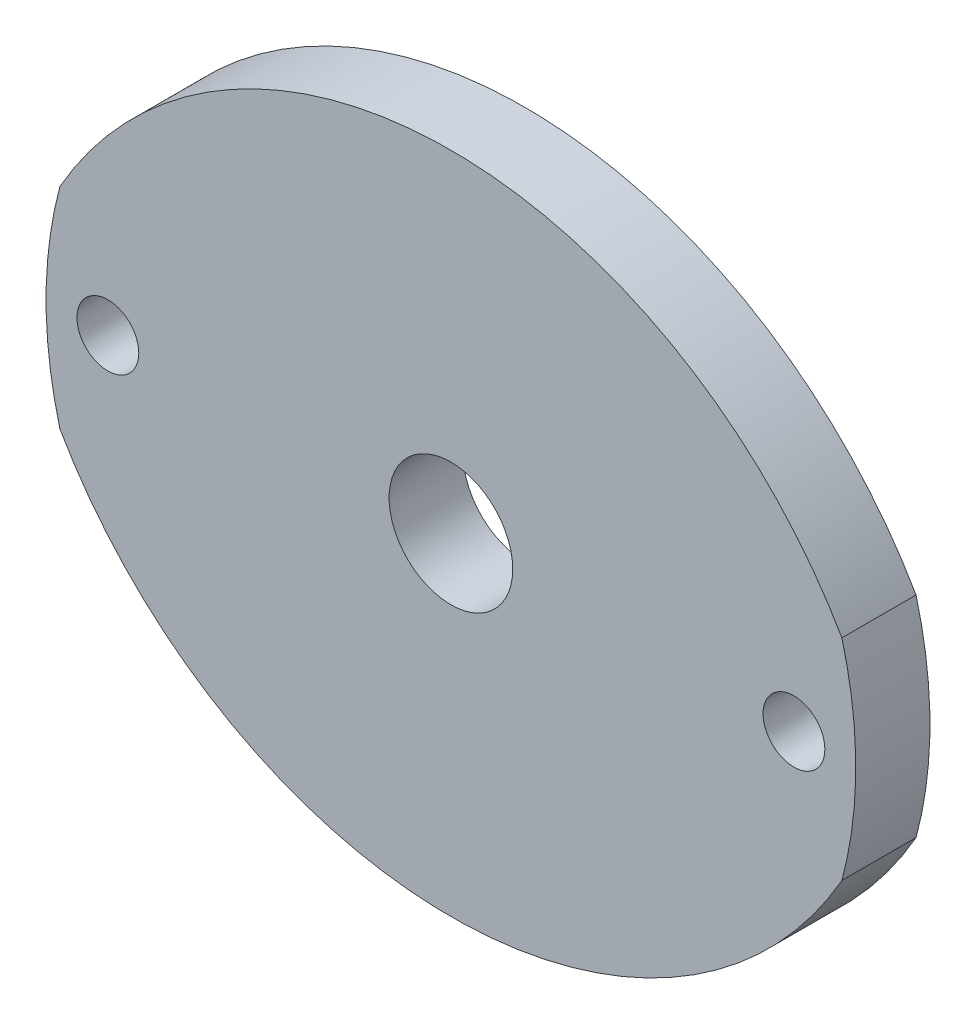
from build123d import *

# Parameters (mm, degrees)
SKETCH3_R           = 2.5
SKETCH3_R_2         = 1.25
BOSS_EXTRUDE1_DEPTH = 3


with BuildPart() as part:
    # Sketch3 → Boss-Extrude1 (new body)
    with BuildSketch(Plane.XY):
        with BuildLine():
            ThreePointArc((-4.55659993, 310.123320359), (-5.117774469, 305.873196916), (-4.55659993, 301.623073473))
            ThreePointArc((-4.55659993, 301.623073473), (11.257225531, 292.448196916), (27.071050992, 301.623073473))
            ThreePointArc((27.071050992, 301.623073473), (27.632225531, 305.873196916), (27.071050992, 310.123320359))
            ThreePointArc((27.071050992, 310.123320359), (11.257225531, 319.298196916), (-4.55659993, 310.123320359))
        make_face()
        with Locations((11.257225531, 305.873196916)):
            Circle(SKETCH3_R, mode=Mode.SUBTRACT)
        with Locations((25.132225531, 305.873196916)):
            Circle(SKETCH3_R_2, mode=Mode.SUBTRACT)
        with Locations((-2.617774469, 305.873196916)):
            Circle(SKETCH3_R_2, mode=Mode.SUBTRACT)
    extrude(amount=BOSS_EXTRUDE1_DEPTH)


solid = part.part
